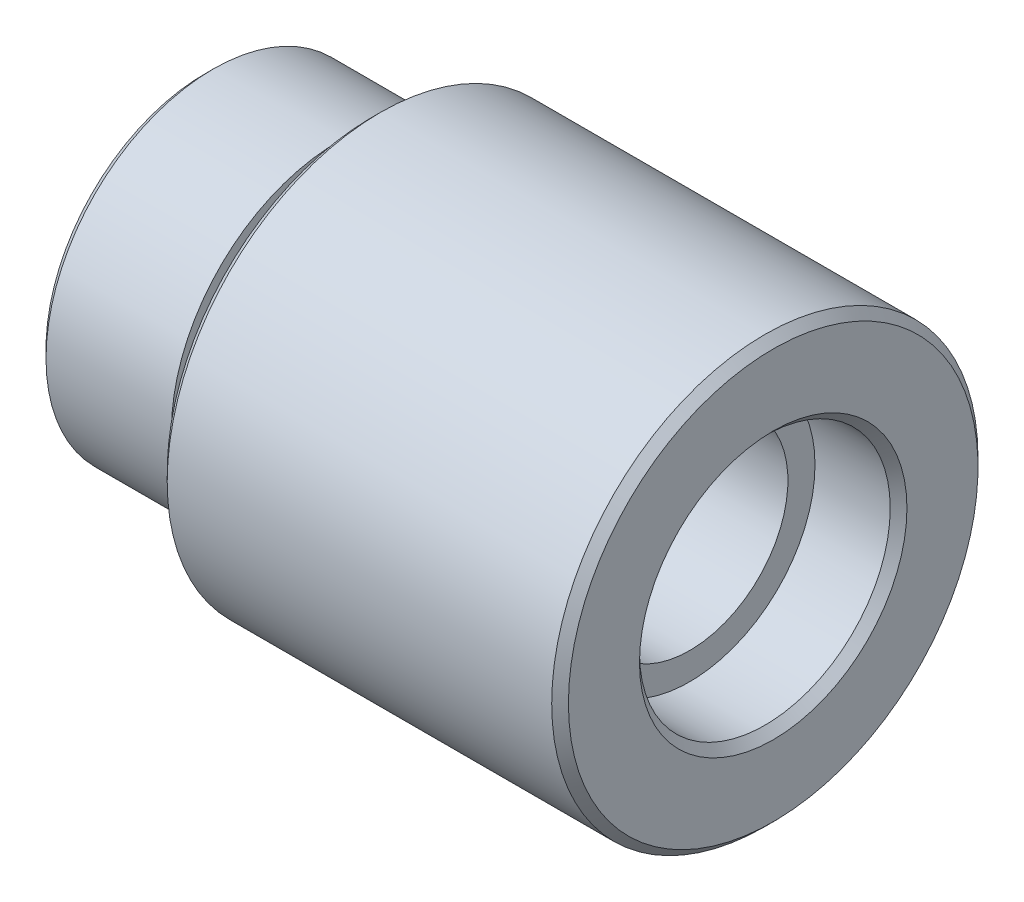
ISO-10303-21;
HEADER;
FILE_DESCRIPTION(('STEP AP214'),'2;1');
FILE_NAME('part.step','',(''),(''),'','','');
FILE_SCHEMA(('AUTOMOTIVE_DESIGN { 1 0 10303 214 1 1 1 1 }'));
ENDSEC;
DATA;
#1=APPLICATION_CONTEXT('core data for automotive mechanical design processes');
#2=APPLICATION_PROTOCOL_DEFINITION('international standard','automotive_design',2000,#1);
#3=PRODUCT_CONTEXT('',#1,'mechanical');
#4=PRODUCT('Part','Part','',(#3));
#5=PRODUCT_RELATED_PRODUCT_CATEGORY('part','',(#4));
#6=PRODUCT_DEFINITION_FORMATION('','',#4);
#7=PRODUCT_DEFINITION_CONTEXT('part definition',#1,'design');
#8=PRODUCT_DEFINITION('design','',#6,#7);
#9=PRODUCT_DEFINITION_SHAPE('','',#8);
#10=(LENGTH_UNIT() NAMED_UNIT(*) SI_UNIT(.MILLI.,.METRE.));
#11=(NAMED_UNIT(*) PLANE_ANGLE_UNIT() SI_UNIT($,.RADIAN.));
#12=(NAMED_UNIT(*) SI_UNIT($,.STERADIAN.) SOLID_ANGLE_UNIT());
#13=UNCERTAINTY_MEASURE_WITH_UNIT(LENGTH_MEASURE(1.E-05),#10,'distance_accuracy_value','');
#14=(GEOMETRIC_REPRESENTATION_CONTEXT(3) GLOBAL_UNCERTAINTY_ASSIGNED_CONTEXT((#13)) GLOBAL_UNIT_ASSIGNED_CONTEXT((#10,
#11,#12)) REPRESENTATION_CONTEXT('',''));
#15=CARTESIAN_POINT('',(0.,0.,0.));
#16=DIRECTION('',(0.,0.,1.));
#17=DIRECTION('',(1.,0.,0.));
#18=AXIS2_PLACEMENT_3D('',#15,#16,#17);
#19=CARTESIAN_POINT('',(0.,10.,0.));
#20=DIRECTION('',(1.,0.,0.));
#21=DIRECTION('',(0.,0.,-1.));
#22=AXIS2_PLACEMENT_3D('',#19,#20,#21);
#23=PLANE('',#22);
#24=CARTESIAN_POINT('',(0.,0.,0.));
#25=DIRECTION('',(1.,0.,0.));
#26=DIRECTION('',(0.,0.,-1.));
#27=AXIS2_PLACEMENT_3D('',#24,#25,#26);
#28=CIRCLE('',#27,9.49999999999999);
#29=CARTESIAN_POINT('',(0.,0.,-9.49999999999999));
#30=VERTEX_POINT('',#29);
#31=EDGE_CURVE('E65',#30,#30,#28,.F.);
#32=ORIENTED_EDGE('',*,*,#31,.T.);
#33=EDGE_LOOP('',(#32));
#34=FACE_BOUND('',#33,.T.);
#35=CARTESIAN_POINT('',(0.,0.,0.));
#36=DIRECTION('',(1.,0.,0.));
#37=DIRECTION('',(0.,0.,-1.));
#38=AXIS2_PLACEMENT_3D('',#35,#36,#37);
#39=CIRCLE('',#38,8.);
#40=CARTESIAN_POINT('',(0.,0.,-8.));
#41=VERTEX_POINT('',#40);
#42=EDGE_CURVE('E68',#41,#41,#39,.T.);
#43=ORIENTED_EDGE('',*,*,#42,.T.);
#44=EDGE_LOOP('',(#43));
#45=FACE_BOUND('',#44,.T.);
#46=ADVANCED_FACE('F34',(#34,#45),#23,.F.);
#47=CARTESIAN_POINT('',(0.,0.,0.));
#48=DIRECTION('',(-1.,0.,0.));
#49=DIRECTION('',(0.,0.,1.));
#50=AXIS2_PLACEMENT_3D('',#47,#48,#49);
#51=CYLINDRICAL_SURFACE('',#50,10.);
#52=CARTESIAN_POINT('',(0.50000000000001,0.,0.));
#53=DIRECTION('',(1.,0.,0.));
#54=DIRECTION('',(0.,0.,-1.));
#55=AXIS2_PLACEMENT_3D('',#52,#53,#54);
#56=CIRCLE('',#55,10.);
#57=CARTESIAN_POINT('',(0.50000000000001,0.,-10.));
#58=VERTEX_POINT('',#57);
#59=EDGE_CURVE('E62',#58,#58,#56,.T.);
#60=ORIENTED_EDGE('',*,*,#59,.T.);
#61=EDGE_LOOP('',(#60));
#62=FACE_BOUND('',#61,.T.);
#63=CARTESIAN_POINT('',(8.,0.,0.));
#64=DIRECTION('',(-1.,0.,0.));
#65=DIRECTION('',(0.,0.,1.));
#66=AXIS2_PLACEMENT_3D('',#63,#64,#65);
#67=CIRCLE('',#66,10.);
#68=CARTESIAN_POINT('',(8.,0.,10.));
#69=VERTEX_POINT('',#68);
#70=EDGE_CURVE('E71',#69,#69,#67,.T.);
#71=ORIENTED_EDGE('',*,*,#70,.T.);
#72=EDGE_LOOP('',(#71));
#73=FACE_BOUND('',#72,.T.);
#74=ADVANCED_FACE('F110',(#62,#73),#51,.T.);
#75=CARTESIAN_POINT('',(8.,9.24999999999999,0.));
#76=DIRECTION('',(-1.,0.,0.));
#77=DIRECTION('',(0.,0.,1.));
#78=AXIS2_PLACEMENT_3D('',#75,#76,#77);
#79=PLANE('',#78);
#80=ORIENTED_EDGE('',*,*,#70,.F.);
#81=EDGE_LOOP('',(#80));
#82=FACE_BOUND('',#81,.T.);
#83=CARTESIAN_POINT('',(8.,0.,0.));
#84=DIRECTION('',(-1.,0.,0.));
#85=DIRECTION('',(0.,0.,1.));
#86=AXIS2_PLACEMENT_3D('',#83,#84,#85);
#87=CIRCLE('',#86,9.24999999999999);
#88=CARTESIAN_POINT('',(8.,0.,9.24999999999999));
#89=VERTEX_POINT('',#88);
#90=EDGE_CURVE('E74',#89,#89,#87,.T.);
#91=ORIENTED_EDGE('',*,*,#90,.T.);
#92=EDGE_LOOP('',(#91));
#93=FACE_BOUND('',#92,.T.);
#94=ADVANCED_FACE('F115',(#82,#93),#79,.F.);
#95=CARTESIAN_POINT('',(0.,0.,0.));
#96=DIRECTION('',(-1.,0.,0.));
#97=DIRECTION('',(0.,0.,1.));
#98=AXIS2_PLACEMENT_3D('',#95,#96,#97);
#99=CYLINDRICAL_SURFACE('',#98,9.24999999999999);
#100=ORIENTED_EDGE('',*,*,#90,.F.);
#101=EDGE_LOOP('',(#100));
#102=FACE_BOUND('',#101,.T.);
#103=CARTESIAN_POINT('',(10.,0.,0.));
#104=DIRECTION('',(-1.,0.,0.));
#105=DIRECTION('',(0.,0.,1.));
#106=AXIS2_PLACEMENT_3D('',#103,#104,#105);
#107=CIRCLE('',#106,9.24999999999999);
#108=CARTESIAN_POINT('',(10.,0.,9.24999999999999));
#109=VERTEX_POINT('',#108);
#110=EDGE_CURVE('E77',#109,#109,#107,.T.);
#111=ORIENTED_EDGE('',*,*,#110,.T.);
#112=EDGE_LOOP('',(#111));
#113=FACE_BOUND('',#112,.T.);
#114=ADVANCED_FACE('F156',(#102,#113),#99,.T.);
#115=CARTESIAN_POINT('',(10.,12.75,0.));
#116=DIRECTION('',(1.,0.,0.));
#117=DIRECTION('',(0.,0.,-1.));
#118=AXIS2_PLACEMENT_3D('',#115,#116,#117);
#119=PLANE('',#118);
#120=CARTESIAN_POINT('',(10.,0.,0.));
#121=DIRECTION('',(1.,0.,0.));
#122=DIRECTION('',(0.,0.,-1.));
#123=AXIS2_PLACEMENT_3D('',#120,#121,#122);
#124=CIRCLE('',#123,12.25);
#125=CARTESIAN_POINT('',(10.,0.,-12.25));
#126=VERTEX_POINT('',#125);
#127=EDGE_CURVE('E44',#126,#126,#124,.F.);
#128=ORIENTED_EDGE('',*,*,#127,.T.);
#129=EDGE_LOOP('',(#128));
#130=FACE_BOUND('',#129,.T.);
#131=ORIENTED_EDGE('',*,*,#110,.F.);
#132=EDGE_LOOP('',(#131));
#133=FACE_BOUND('',#132,.T.);
#134=ADVANCED_FACE('F148',(#130,#133),#119,.F.);
#135=CARTESIAN_POINT('',(0.,0.,0.));
#136=DIRECTION('',(-1.,0.,0.));
#137=DIRECTION('',(0.,0.,1.));
#138=AXIS2_PLACEMENT_3D('',#135,#136,#137);
#139=CYLINDRICAL_SURFACE('',#138,12.75);
#140=CARTESIAN_POINT('',(33.5,0.,0.));
#141=DIRECTION('',(-1.,0.,0.));
#142=DIRECTION('',(0.,0.,1.));
#143=AXIS2_PLACEMENT_3D('',#140,#141,#142);
#144=CIRCLE('',#143,12.75);
#145=CARTESIAN_POINT('',(33.5,0.,12.75));
#146=VERTEX_POINT('',#145);
#147=EDGE_CURVE('E56',#146,#146,#144,.T.);
#148=ORIENTED_EDGE('',*,*,#147,.T.);
#149=EDGE_LOOP('',(#148));
#150=FACE_BOUND('',#149,.T.);
#151=CARTESIAN_POINT('',(10.5,0.,0.));
#152=DIRECTION('',(1.,0.,0.));
#153=DIRECTION('',(0.,0.,-1.));
#154=AXIS2_PLACEMENT_3D('',#151,#152,#153);
#155=CIRCLE('',#154,12.75);
#156=CARTESIAN_POINT('',(10.5,0.,-12.75));
#157=VERTEX_POINT('',#156);
#158=EDGE_CURVE('E59',#157,#157,#155,.T.);
#159=ORIENTED_EDGE('',*,*,#158,.T.);
#160=EDGE_LOOP('',(#159));
#161=FACE_BOUND('',#160,.T.);
#162=ADVANCED_FACE('F144',(#150,#161),#139,.T.);
#163=CARTESIAN_POINT('',(34.,7.5,0.));
#164=DIRECTION('',(-1.,0.,0.));
#165=DIRECTION('',(0.,0.,1.));
#166=AXIS2_PLACEMENT_3D('',#163,#164,#165);
#167=PLANE('',#166);
#168=CARTESIAN_POINT('',(34.,0.,0.));
#169=DIRECTION('',(-1.,0.,0.));
#170=DIRECTION('',(0.,0.,1.));
#171=AXIS2_PLACEMENT_3D('',#168,#169,#170);
#172=CIRCLE('',#171,12.25);
#173=CARTESIAN_POINT('',(34.,0.,12.25));
#174=VERTEX_POINT('',#173);
#175=EDGE_CURVE('E48',#174,#174,#172,.F.);
#176=ORIENTED_EDGE('',*,*,#175,.T.);
#177=EDGE_LOOP('',(#176));
#178=FACE_BOUND('',#177,.T.);
#179=CARTESIAN_POINT('',(34.,0.,0.));
#180=DIRECTION('',(-1.,0.,0.));
#181=DIRECTION('',(0.,0.,1.));
#182=AXIS2_PLACEMENT_3D('',#179,#180,#181);
#183=CIRCLE('',#182,8.00000000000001);
#184=CARTESIAN_POINT('',(34.,0.,8.00000000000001));
#185=VERTEX_POINT('',#184);
#186=EDGE_CURVE('E53',#185,#185,#183,.T.);
#187=ORIENTED_EDGE('',*,*,#186,.T.);
#188=EDGE_LOOP('',(#187));
#189=FACE_BOUND('',#188,.T.);
#190=ADVANCED_FACE('F147',(#178,#189),#167,.F.);
#191=CARTESIAN_POINT('',(0.,0.,0.));
#192=DIRECTION('',(-1.,0.,0.));
#193=DIRECTION('',(0.,0.,1.));
#194=AXIS2_PLACEMENT_3D('',#191,#192,#193);
#195=CYLINDRICAL_SURFACE('',#194,7.5);
#196=CARTESIAN_POINT('',(33.5,0.,0.));
#197=DIRECTION('',(-1.,0.,0.));
#198=DIRECTION('',(0.,0.,1.));
#199=AXIS2_PLACEMENT_3D('',#196,#197,#198);
#200=CIRCLE('',#199,7.5);
#201=CARTESIAN_POINT('',(33.5,0.,7.5));
#202=VERTEX_POINT('',#201);
#203=EDGE_CURVE('E40',#202,#202,#200,.F.);
#204=ORIENTED_EDGE('',*,*,#203,.T.);
#205=EDGE_LOOP('',(#204));
#206=FACE_BOUND('',#205,.T.);
#207=CARTESIAN_POINT('',(29.,0.,0.));
#208=DIRECTION('',(-1.,0.,0.));
#209=DIRECTION('',(0.,0.,1.));
#210=AXIS2_PLACEMENT_3D('',#207,#208,#209);
#211=CIRCLE('',#210,7.5);
#212=CARTESIAN_POINT('',(29.,0.,7.5));
#213=VERTEX_POINT('',#212);
#214=EDGE_CURVE('E80',#213,#213,#211,.T.);
#215=ORIENTED_EDGE('',*,*,#214,.T.);
#216=EDGE_LOOP('',(#215));
#217=FACE_BOUND('',#216,.T.);
#218=ADVANCED_FACE('F172',(#206,#217),#195,.F.);
#219=CARTESIAN_POINT('',(29.,5.88,0.));
#220=DIRECTION('',(-1.,0.,0.));
#221=DIRECTION('',(0.,0.,1.));
#222=AXIS2_PLACEMENT_3D('',#219,#220,#221);
#223=PLANE('',#222);
#224=ORIENTED_EDGE('',*,*,#214,.F.);
#225=EDGE_LOOP('',(#224));
#226=FACE_BOUND('',#225,.T.);
#227=CARTESIAN_POINT('',(29.,0.,0.));
#228=DIRECTION('',(-1.,0.,0.));
#229=DIRECTION('',(0.,0.,1.));
#230=AXIS2_PLACEMENT_3D('',#227,#228,#229);
#231=CIRCLE('',#230,5.88);
#232=CARTESIAN_POINT('',(29.,0.,5.88));
#233=VERTEX_POINT('',#232);
#234=EDGE_CURVE('E83',#233,#233,#231,.T.);
#235=ORIENTED_EDGE('',*,*,#234,.T.);
#236=EDGE_LOOP('',(#235));
#237=FACE_BOUND('',#236,.T.);
#238=ADVANCED_FACE('F176',(#226,#237),#223,.F.);
#239=CARTESIAN_POINT('',(0.,0.,0.));
#240=DIRECTION('',(-1.,0.,0.));
#241=DIRECTION('',(0.,0.,1.));
#242=AXIS2_PLACEMENT_3D('',#239,#240,#241);
#243=CYLINDRICAL_SURFACE('',#242,5.88);
#244=ORIENTED_EDGE('',*,*,#234,.F.);
#245=EDGE_LOOP('',(#244));
#246=FACE_BOUND('',#245,.T.);
#247=CARTESIAN_POINT('',(5.,0.,0.));
#248=DIRECTION('',(-1.,0.,0.));
#249=DIRECTION('',(0.,0.,1.));
#250=AXIS2_PLACEMENT_3D('',#247,#248,#249);
#251=CIRCLE('',#250,5.88);
#252=CARTESIAN_POINT('',(5.,0.,5.88));
#253=VERTEX_POINT('',#252);
#254=EDGE_CURVE('E86',#253,#253,#251,.T.);
#255=ORIENTED_EDGE('',*,*,#254,.T.);
#256=EDGE_LOOP('',(#255));
#257=FACE_BOUND('',#256,.T.);
#258=ADVANCED_FACE('F106',(#246,#257),#243,.F.);
#259=CARTESIAN_POINT('',(5.,7.5,0.));
#260=DIRECTION('',(1.,0.,0.));
#261=DIRECTION('',(0.,0.,-1.));
#262=AXIS2_PLACEMENT_3D('',#259,#260,#261);
#263=PLANE('',#262);
#264=ORIENTED_EDGE('',*,*,#254,.F.);
#265=EDGE_LOOP('',(#264));
#266=FACE_BOUND('',#265,.T.);
#267=CARTESIAN_POINT('',(5.,0.,0.));
#268=DIRECTION('',(-1.,0.,0.));
#269=DIRECTION('',(0.,0.,1.));
#270=AXIS2_PLACEMENT_3D('',#267,#268,#269);
#271=CIRCLE('',#270,7.5);
#272=CARTESIAN_POINT('',(5.,0.,7.5));
#273=VERTEX_POINT('',#272);
#274=EDGE_CURVE('E89',#273,#273,#271,.T.);
#275=ORIENTED_EDGE('',*,*,#274,.T.);
#276=EDGE_LOOP('',(#275));
#277=FACE_BOUND('',#276,.T.);
#278=ADVANCED_FACE('F93',(#266,#277),#263,.F.);
#279=CARTESIAN_POINT('',(0.,0.,0.));
#280=DIRECTION('',(-1.,0.,0.));
#281=DIRECTION('',(0.,0.,1.));
#282=AXIS2_PLACEMENT_3D('',#279,#280,#281);
#283=CYLINDRICAL_SURFACE('',#282,7.5);
#284=CARTESIAN_POINT('',(0.50000000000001,0.,0.));
#285=DIRECTION('',(1.,0.,0.));
#286=DIRECTION('',(0.,0.,-1.));
#287=AXIS2_PLACEMENT_3D('',#284,#285,#286);
#288=CIRCLE('',#287,7.5);
#289=CARTESIAN_POINT('',(0.50000000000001,0.,-7.5));
#290=VERTEX_POINT('',#289);
#291=EDGE_CURVE('E10',#290,#290,#288,.F.);
#292=ORIENTED_EDGE('',*,*,#291,.T.);
#293=EDGE_LOOP('',(#292));
#294=FACE_BOUND('',#293,.T.);
#295=ORIENTED_EDGE('',*,*,#274,.F.);
#296=EDGE_LOOP('',(#295));
#297=FACE_BOUND('',#296,.T.);
#298=ADVANCED_FACE('F95',(#294,#297),#283,.F.);
#299=CARTESIAN_POINT('',(0.,0.,0.));
#300=DIRECTION('',(1.,0.,0.));
#301=DIRECTION('',(0.,0.,-1.));
#302=AXIS2_PLACEMENT_3D('',#299,#300,#301);
#303=CONICAL_SURFACE('',#302,9.49999999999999,0.785398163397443);
#304=ORIENTED_EDGE('',*,*,#59,.F.);
#305=EDGE_LOOP('',(#304));
#306=FACE_BOUND('',#305,.T.);
#307=ORIENTED_EDGE('',*,*,#31,.F.);
#308=EDGE_LOOP('',(#307));
#309=FACE_BOUND('',#308,.T.);
#310=ADVANCED_FACE('F97',(#306,#309),#303,.T.);
#311=CARTESIAN_POINT('',(33.5,0.,0.));
#312=DIRECTION('',(-1.,0.,0.));
#313=DIRECTION('',(0.,0.,1.));
#314=AXIS2_PLACEMENT_3D('',#311,#312,#313);
#315=CONICAL_SURFACE('',#314,12.75,0.785398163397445);
#316=ORIENTED_EDGE('',*,*,#175,.F.);
#317=EDGE_LOOP('',(#316));
#318=FACE_BOUND('',#317,.T.);
#319=ORIENTED_EDGE('',*,*,#147,.F.);
#320=EDGE_LOOP('',(#319));
#321=FACE_BOUND('',#320,.T.);
#322=ADVANCED_FACE('F103',(#318,#321),#315,.T.);
#323=CARTESIAN_POINT('',(10.,0.,0.));
#324=DIRECTION('',(1.,0.,0.));
#325=DIRECTION('',(0.,0.,-1.));
#326=AXIS2_PLACEMENT_3D('',#323,#324,#325);
#327=CONICAL_SURFACE('',#326,12.25,0.785398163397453);
#328=ORIENTED_EDGE('',*,*,#158,.F.);
#329=EDGE_LOOP('',(#328));
#330=FACE_BOUND('',#329,.T.);
#331=ORIENTED_EDGE('',*,*,#127,.F.);
#332=EDGE_LOOP('',(#331));
#333=FACE_BOUND('',#332,.T.);
#334=ADVANCED_FACE('F129',(#330,#333),#327,.T.);
#335=CARTESIAN_POINT('',(34.,0.,0.));
#336=DIRECTION('',(1.,0.,0.));
#337=DIRECTION('',(0.,0.,-1.));
#338=AXIS2_PLACEMENT_3D('',#335,#336,#337);
#339=CONICAL_SURFACE('',#338,8.00000000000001,0.785398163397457);
#340=ORIENTED_EDGE('',*,*,#203,.F.);
#341=EDGE_LOOP('',(#340));
#342=FACE_BOUND('',#341,.T.);
#343=ORIENTED_EDGE('',*,*,#186,.F.);
#344=EDGE_LOOP('',(#343));
#345=FACE_BOUND('',#344,.T.);
#346=ADVANCED_FACE('F124',(#342,#345),#339,.F.);
#347=CARTESIAN_POINT('',(0.50000000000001,0.,0.));
#348=DIRECTION('',(-1.,0.,0.));
#349=DIRECTION('',(0.,0.,1.));
#350=AXIS2_PLACEMENT_3D('',#347,#348,#349);
#351=CONICAL_SURFACE('',#350,7.5,0.785398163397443);
#352=ORIENTED_EDGE('',*,*,#42,.F.);
#353=EDGE_LOOP('',(#352));
#354=FACE_BOUND('',#353,.T.);
#355=ORIENTED_EDGE('',*,*,#291,.F.);
#356=EDGE_LOOP('',(#355));
#357=FACE_BOUND('',#356,.T.);
#358=ADVANCED_FACE('F121',(#354,#357),#351,.F.);
#359=CLOSED_SHELL('',(#46,#74,#94,#114,#134,#162,#190,#218,#238,#258,#278,#298,#310,#322,#334,
#346,#358));
#360=MANIFOLD_SOLID_BREP('B2',#359);
#361=ADVANCED_BREP_SHAPE_REPRESENTATION('',(#18,#360),#14);
#362=SHAPE_DEFINITION_REPRESENTATION(#9,#361);
ENDSEC;
END-ISO-10303-21;
